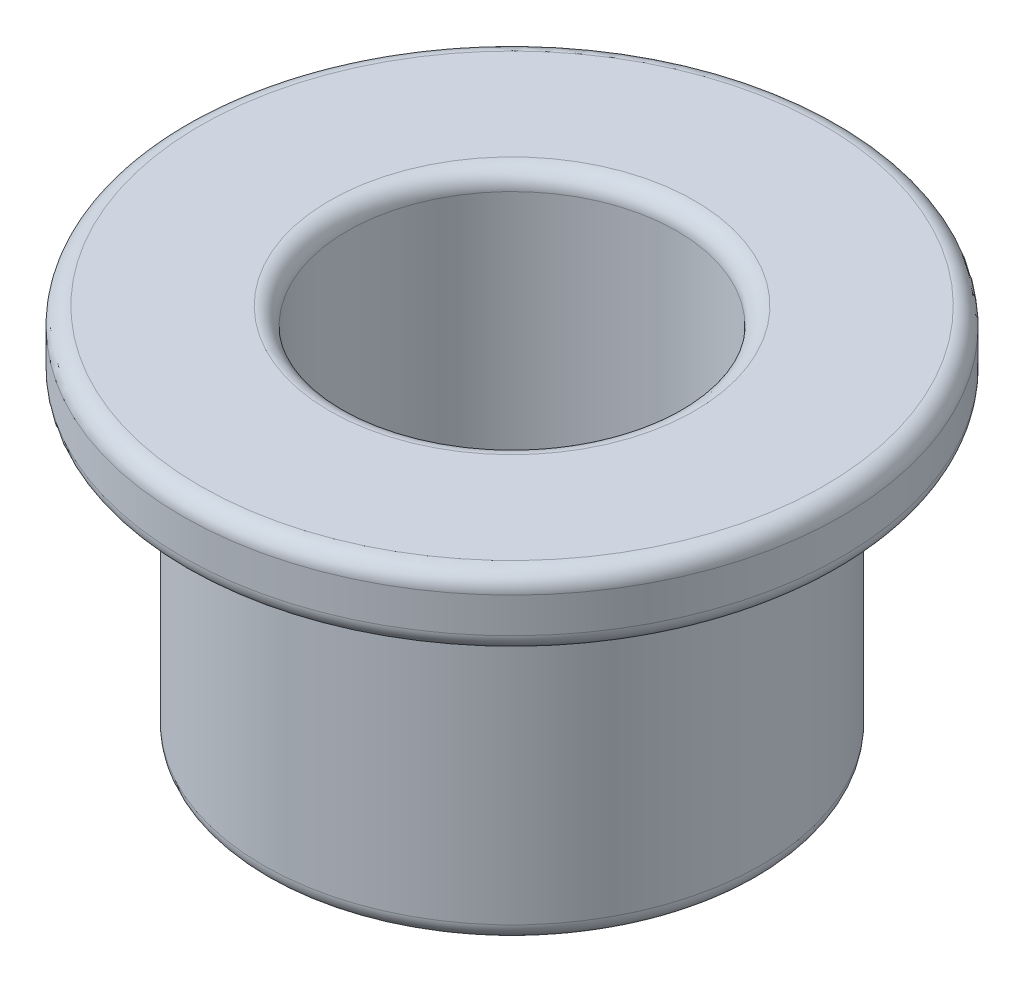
ISO-10303-21;
HEADER;
FILE_DESCRIPTION(('STEP AP214'),'2;1');
FILE_NAME('part.step','',(''),(''),'','','');
FILE_SCHEMA(('AUTOMOTIVE_DESIGN { 1 0 10303 214 1 1 1 1 }'));
ENDSEC;
DATA;
#1=APPLICATION_CONTEXT('core data for automotive mechanical design processes');
#2=APPLICATION_PROTOCOL_DEFINITION('international standard','automotive_design',2000,#1);
#3=PRODUCT_CONTEXT('',#1,'mechanical');
#4=PRODUCT('Part','Part','',(#3));
#5=PRODUCT_RELATED_PRODUCT_CATEGORY('part','',(#4));
#6=PRODUCT_DEFINITION_FORMATION('','',#4);
#7=PRODUCT_DEFINITION_CONTEXT('part definition',#1,'design');
#8=PRODUCT_DEFINITION('design','',#6,#7);
#9=PRODUCT_DEFINITION_SHAPE('','',#8);
#10=(LENGTH_UNIT() NAMED_UNIT(*) SI_UNIT(.MILLI.,.METRE.));
#11=(NAMED_UNIT(*) PLANE_ANGLE_UNIT() SI_UNIT($,.RADIAN.));
#12=(NAMED_UNIT(*) SI_UNIT($,.STERADIAN.) SOLID_ANGLE_UNIT());
#13=UNCERTAINTY_MEASURE_WITH_UNIT(LENGTH_MEASURE(1.E-05),#10,'distance_accuracy_value','');
#14=(GEOMETRIC_REPRESENTATION_CONTEXT(3) GLOBAL_UNCERTAINTY_ASSIGNED_CONTEXT((#13)) GLOBAL_UNIT_ASSIGNED_CONTEXT((#10,
#11,#12)) REPRESENTATION_CONTEXT('',''));
#15=CARTESIAN_POINT('',(0.,0.,0.));
#16=DIRECTION('',(0.,0.,1.));
#17=DIRECTION('',(1.,0.,0.));
#18=AXIS2_PLACEMENT_3D('',#15,#16,#17);
#19=CARTESIAN_POINT('',(0.,4.445,0.));
#20=DIRECTION('',(0.,-1.,0.));
#21=DIRECTION('',(0.,0.,-1.));
#22=AXIS2_PLACEMENT_3D('',#19,#20,#21);
#23=CYLINDRICAL_SURFACE('',#22,3.5941);
#24=CARTESIAN_POINT('',(0.,4.191,0.));
#25=DIRECTION('',(0.,1.,0.));
#26=DIRECTION('',(0.,0.,1.));
#27=AXIS2_PLACEMENT_3D('',#24,#25,#26);
#28=CIRCLE('',#27,3.5941);
#29=CARTESIAN_POINT('',(0.,4.191,3.5941));
#30=VERTEX_POINT('',#29);
#31=EDGE_CURVE('E55',#30,#30,#28,.F.);
#32=ORIENTED_EDGE('',*,*,#31,.T.);
#33=EDGE_LOOP('',(#32));
#34=FACE_BOUND('',#33,.T.);
#35=CARTESIAN_POINT('',(0.,0.254,0.));
#36=DIRECTION('',(0.,1.,0.));
#37=DIRECTION('',(0.,0.,1.));
#38=AXIS2_PLACEMENT_3D('',#35,#36,#37);
#39=CIRCLE('',#38,3.5941);
#40=CARTESIAN_POINT('',(0.,0.254,3.5941));
#41=VERTEX_POINT('',#40);
#42=EDGE_CURVE('E58',#41,#41,#39,.T.);
#43=ORIENTED_EDGE('',*,*,#42,.T.);
#44=EDGE_LOOP('',(#43));
#45=FACE_BOUND('',#44,.T.);
#46=ADVANCED_FACE('F24',(#34,#45),#23,.T.);
#47=CARTESIAN_POINT('',(0.,0.,0.));
#48=DIRECTION('',(0.,1.,0.));
#49=DIRECTION('',(0.,0.,1.));
#50=AXIS2_PLACEMENT_3D('',#47,#48,#49);
#51=PLANE('',#50);
#52=CARTESIAN_POINT('',(0.,0.,0.));
#53=DIRECTION('',(0.,1.,0.));
#54=DIRECTION('',(0.,0.,1.));
#55=AXIS2_PLACEMENT_3D('',#52,#53,#54);
#56=CIRCLE('',#55,3.3401);
#57=CARTESIAN_POINT('',(0.,0.,3.3401));
#58=VERTEX_POINT('',#57);
#59=EDGE_CURVE('E43',#58,#58,#56,.F.);
#60=ORIENTED_EDGE('',*,*,#59,.T.);
#61=EDGE_LOOP('',(#60));
#62=FACE_BOUND('',#61,.T.);
#63=CARTESIAN_POINT('',(0.,0.,0.));
#64=DIRECTION('',(0.,1.,0.));
#65=DIRECTION('',(0.,0.,1.));
#66=AXIS2_PLACEMENT_3D('',#63,#64,#65);
#67=CIRCLE('',#66,2.63525);
#68=CARTESIAN_POINT('',(0.,0.,2.63525));
#69=VERTEX_POINT('',#68);
#70=EDGE_CURVE('E46',#69,#69,#67,.T.);
#71=ORIENTED_EDGE('',*,*,#70,.T.);
#72=EDGE_LOOP('',(#71));
#73=FACE_BOUND('',#72,.T.);
#74=ADVANCED_FACE('F100',(#62,#73),#51,.F.);
#75=CARTESIAN_POINT('',(0.,4.445,0.));
#76=DIRECTION('',(0.,1.,0.));
#77=DIRECTION('',(0.,0.,1.));
#78=AXIS2_PLACEMENT_3D('',#75,#76,#77);
#79=PLANE('',#78);
#80=CARTESIAN_POINT('',(0.,4.445,0.));
#81=DIRECTION('',(0.,1.,0.));
#82=DIRECTION('',(0.,0.,1.));
#83=AXIS2_PLACEMENT_3D('',#80,#81,#82);
#84=CIRCLE('',#83,3.8481);
#85=CARTESIAN_POINT('',(0.,4.445,3.8481));
#86=VERTEX_POINT('',#85);
#87=EDGE_CURVE('E61',#86,#86,#84,.T.);
#88=ORIENTED_EDGE('',*,*,#87,.T.);
#89=EDGE_LOOP('',(#88));
#90=FACE_BOUND('',#89,.T.);
#91=CARTESIAN_POINT('',(0.,4.445,0.));
#92=DIRECTION('',(0.,1.,0.));
#93=DIRECTION('',(0.,0.,1.));
#94=AXIS2_PLACEMENT_3D('',#91,#92,#93);
#95=CIRCLE('',#94,4.5085);
#96=CARTESIAN_POINT('',(0.,4.445,4.5085));
#97=VERTEX_POINT('',#96);
#98=EDGE_CURVE('E64',#97,#97,#95,.F.);
#99=ORIENTED_EDGE('',*,*,#98,.T.);
#100=EDGE_LOOP('',(#99));
#101=FACE_BOUND('',#100,.T.);
#102=ADVANCED_FACE('F68',(#90,#101),#79,.F.);
#103=CARTESIAN_POINT('',(0.,5.461,0.));
#104=DIRECTION('',(0.,-1.,0.));
#105=DIRECTION('',(0.,0.,-1.));
#106=AXIS2_PLACEMENT_3D('',#103,#104,#105);
#107=CYLINDRICAL_SURFACE('',#106,4.7625);
#108=CARTESIAN_POINT('',(0.,4.699,0.));
#109=DIRECTION('',(0.,1.,0.));
#110=DIRECTION('',(0.,0.,1.));
#111=AXIS2_PLACEMENT_3D('',#108,#109,#110);
#112=CIRCLE('',#111,4.7625);
#113=CARTESIAN_POINT('',(0.,4.699,4.7625));
#114=VERTEX_POINT('',#113);
#115=EDGE_CURVE('E49',#114,#114,#112,.T.);
#116=ORIENTED_EDGE('',*,*,#115,.T.);
#117=EDGE_LOOP('',(#116));
#118=FACE_BOUND('',#117,.T.);
#119=CARTESIAN_POINT('',(0.,5.207,0.));
#120=DIRECTION('',(0.,1.,0.));
#121=DIRECTION('',(0.,0.,1.));
#122=AXIS2_PLACEMENT_3D('',#119,#120,#121);
#123=CIRCLE('',#122,4.7625);
#124=CARTESIAN_POINT('',(0.,5.207,4.7625));
#125=VERTEX_POINT('',#124);
#126=EDGE_CURVE('E52',#125,#125,#123,.F.);
#127=ORIENTED_EDGE('',*,*,#126,.T.);
#128=EDGE_LOOP('',(#127));
#129=FACE_BOUND('',#128,.T.);
#130=ADVANCED_FACE('F78',(#118,#129),#107,.T.);
#131=CARTESIAN_POINT('',(0.,5.461,0.));
#132=DIRECTION('',(0.,1.,0.));
#133=DIRECTION('',(0.,0.,1.));
#134=AXIS2_PLACEMENT_3D('',#131,#132,#133);
#135=PLANE('',#134);
#136=CARTESIAN_POINT('',(0.,5.461,0.));
#137=DIRECTION('',(0.,1.,0.));
#138=DIRECTION('',(0.,0.,1.));
#139=AXIS2_PLACEMENT_3D('',#136,#137,#138);
#140=CIRCLE('',#139,4.5085);
#141=CARTESIAN_POINT('',(0.,5.461,4.5085));
#142=VERTEX_POINT('',#141);
#143=EDGE_CURVE('E10',#142,#142,#140,.T.);
#144=ORIENTED_EDGE('',*,*,#143,.T.);
#145=EDGE_LOOP('',(#144));
#146=FACE_BOUND('',#145,.T.);
#147=CARTESIAN_POINT('',(0.,5.461,0.));
#148=DIRECTION('',(0.,1.,0.));
#149=DIRECTION('',(0.,0.,1.));
#150=AXIS2_PLACEMENT_3D('',#147,#148,#149);
#151=CIRCLE('',#150,2.63525);
#152=CARTESIAN_POINT('',(0.,5.461,2.63525));
#153=VERTEX_POINT('',#152);
#154=EDGE_CURVE('E30',#153,#153,#151,.F.);
#155=ORIENTED_EDGE('',*,*,#154,.T.);
#156=EDGE_LOOP('',(#155));
#157=FACE_BOUND('',#156,.T.);
#158=ADVANCED_FACE('F81',(#146,#157),#135,.T.);
#159=CARTESIAN_POINT('',(0.,0.,0.));
#160=DIRECTION('',(0.,1.,0.));
#161=DIRECTION('',(0.,0.,1.));
#162=AXIS2_PLACEMENT_3D('',#159,#160,#161);
#163=CYLINDRICAL_SURFACE('',#162,2.38125);
#164=CARTESIAN_POINT('',(0.,0.254,0.));
#165=DIRECTION('',(0.,1.,0.));
#166=DIRECTION('',(0.,0.,1.));
#167=AXIS2_PLACEMENT_3D('',#164,#165,#166);
#168=CIRCLE('',#167,2.38125);
#169=CARTESIAN_POINT('',(0.,0.254,2.38125));
#170=VERTEX_POINT('',#169);
#171=EDGE_CURVE('E34',#170,#170,#168,.F.);
#172=ORIENTED_EDGE('',*,*,#171,.T.);
#173=EDGE_LOOP('',(#172));
#174=FACE_BOUND('',#173,.T.);
#175=CARTESIAN_POINT('',(0.,5.207,0.));
#176=DIRECTION('',(0.,1.,0.));
#177=DIRECTION('',(0.,0.,1.));
#178=AXIS2_PLACEMENT_3D('',#175,#176,#177);
#179=CIRCLE('',#178,2.38125);
#180=CARTESIAN_POINT('',(0.,5.207,2.38125));
#181=VERTEX_POINT('',#180);
#182=EDGE_CURVE('E38',#181,#181,#179,.T.);
#183=ORIENTED_EDGE('',*,*,#182,.T.);
#184=EDGE_LOOP('',(#183));
#185=FACE_BOUND('',#184,.T.);
#186=ADVANCED_FACE('F119',(#174,#185),#163,.F.);
#187=CARTESIAN_POINT('',(0.,4.191,0.));
#188=DIRECTION('',(0.,1.,0.));
#189=DIRECTION('',(0.,0.,1.));
#190=AXIS2_PLACEMENT_3D('',#187,#188,#189);
#191=TOROIDAL_SURFACE('',#190,3.8481,0.254);
#192=ORIENTED_EDGE('',*,*,#31,.F.);
#193=EDGE_LOOP('',(#192));
#194=FACE_BOUND('',#193,.T.);
#195=ORIENTED_EDGE('',*,*,#87,.F.);
#196=EDGE_LOOP('',(#195));
#197=FACE_BOUND('',#196,.T.);
#198=ADVANCED_FACE('F74',(#194,#197),#191,.F.);
#199=CARTESIAN_POINT('',(0.,4.699,0.));
#200=DIRECTION('',(0.,1.,0.));
#201=DIRECTION('',(0.,0.,1.));
#202=AXIS2_PLACEMENT_3D('',#199,#200,#201);
#203=TOROIDAL_SURFACE('',#202,4.5085,0.254);
#204=ORIENTED_EDGE('',*,*,#98,.F.);
#205=EDGE_LOOP('',(#204));
#206=FACE_BOUND('',#205,.T.);
#207=ORIENTED_EDGE('',*,*,#115,.F.);
#208=EDGE_LOOP('',(#207));
#209=FACE_BOUND('',#208,.T.);
#210=ADVANCED_FACE('F70',(#206,#209),#203,.T.);
#211=CARTESIAN_POINT('',(0.,0.254,0.));
#212=DIRECTION('',(0.,1.,0.));
#213=DIRECTION('',(0.,0.,1.));
#214=AXIS2_PLACEMENT_3D('',#211,#212,#213);
#215=TOROIDAL_SURFACE('',#214,3.3401,0.254);
#216=ORIENTED_EDGE('',*,*,#59,.F.);
#217=EDGE_LOOP('',(#216));
#218=FACE_BOUND('',#217,.T.);
#219=ORIENTED_EDGE('',*,*,#42,.F.);
#220=EDGE_LOOP('',(#219));
#221=FACE_BOUND('',#220,.T.);
#222=ADVANCED_FACE('F73',(#218,#221),#215,.T.);
#223=CARTESIAN_POINT('',(0.,0.254,0.));
#224=DIRECTION('',(0.,1.,0.));
#225=DIRECTION('',(0.,0.,1.));
#226=AXIS2_PLACEMENT_3D('',#223,#224,#225);
#227=TOROIDAL_SURFACE('',#226,2.63525,0.254);
#228=ORIENTED_EDGE('',*,*,#171,.F.);
#229=EDGE_LOOP('',(#228));
#230=FACE_BOUND('',#229,.T.);
#231=ORIENTED_EDGE('',*,*,#70,.F.);
#232=EDGE_LOOP('',(#231));
#233=FACE_BOUND('',#232,.T.);
#234=ADVANCED_FACE('F89',(#230,#233),#227,.T.);
#235=CARTESIAN_POINT('',(0.,5.207,0.));
#236=DIRECTION('',(0.,1.,0.));
#237=DIRECTION('',(0.,0.,1.));
#238=AXIS2_PLACEMENT_3D('',#235,#236,#237);
#239=TOROIDAL_SURFACE('',#238,4.5085,0.254);
#240=ORIENTED_EDGE('',*,*,#126,.F.);
#241=EDGE_LOOP('',(#240));
#242=FACE_BOUND('',#241,.T.);
#243=ORIENTED_EDGE('',*,*,#143,.F.);
#244=EDGE_LOOP('',(#243));
#245=FACE_BOUND('',#244,.T.);
#246=ADVANCED_FACE('F85',(#242,#245),#239,.T.);
#247=CARTESIAN_POINT('',(0.,5.207,0.));
#248=DIRECTION('',(0.,1.,0.));
#249=DIRECTION('',(0.,0.,1.));
#250=AXIS2_PLACEMENT_3D('',#247,#248,#249);
#251=TOROIDAL_SURFACE('',#250,2.63525,0.254);
#252=ORIENTED_EDGE('',*,*,#154,.F.);
#253=EDGE_LOOP('',(#252));
#254=FACE_BOUND('',#253,.T.);
#255=ORIENTED_EDGE('',*,*,#182,.F.);
#256=EDGE_LOOP('',(#255));
#257=FACE_BOUND('',#256,.T.);
#258=ADVANCED_FACE('F88',(#254,#257),#251,.T.);
#259=CLOSED_SHELL('',(#46,#74,#102,#130,#158,#186,#198,#210,#222,#234,#246,#258));
#260=MANIFOLD_SOLID_BREP('B2',#259);
#261=ADVANCED_BREP_SHAPE_REPRESENTATION('',(#18,#260),#14);
#262=SHAPE_DEFINITION_REPRESENTATION(#9,#261);
ENDSEC;
END-ISO-10303-21;
